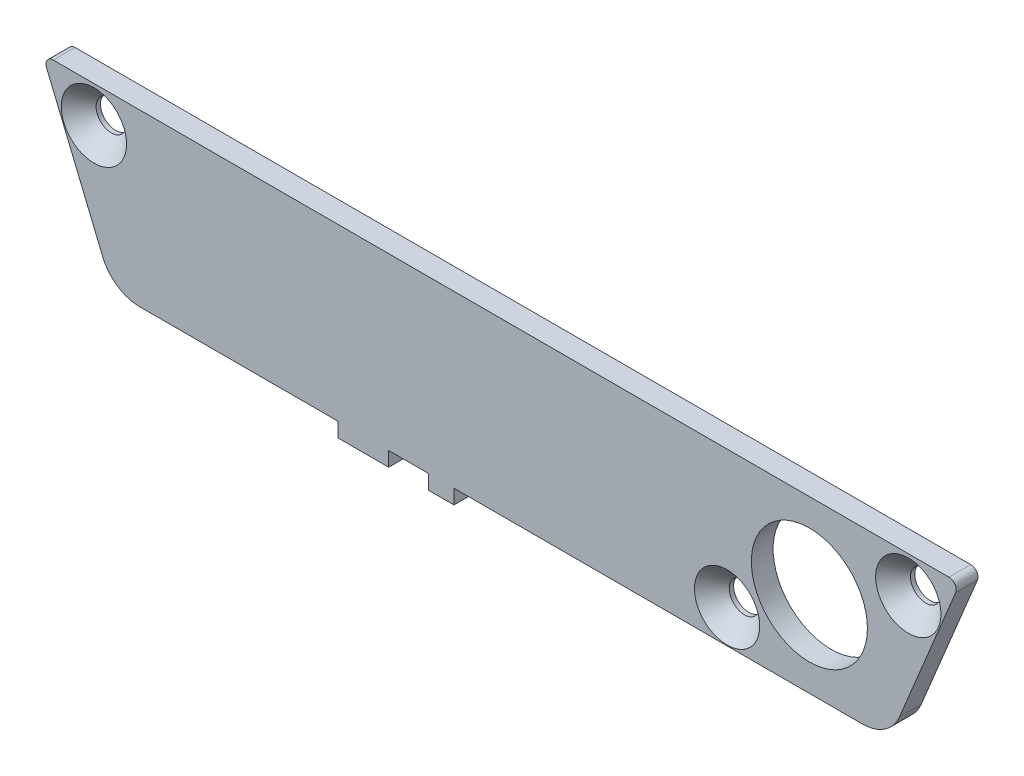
from build123d import *

# Parameters (mm, degrees)
BOSS_EXTRU_1_DEPTH                          = 3
FRAISAGE_POUR_VIS_T_TE_FRAIS_E_M41_AT_COUNT = 2
FRAISAGE_POUR_VIS_T_TE_FRAIS_E_M41_AT_PITCH = 88.387689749
FRAISAGE_POUR_VIS_T_TE_FRAIS_E_M41_2_COUNT  = 2
FRAISAGE_POUR_VIS_T_TE_FRAIS_E_M41_2_PITCH  = 112.275756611
ENL_V_MAT_EXTRU_1_REACH                     = 154.357
ESQUISSE5_R                                 = 8


with BuildPart() as part:
    # Esquisse2 → Boss.-Extru.1 (new body)
    with BuildSketch(Plane.XY.offset(134.349627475)):
        with BuildLine():
            Line((130.529448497, 76.836149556), (7.038520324, 76.836149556))
            ThreePointArc((7.038520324, 76.836149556), (6.207050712, 76.391719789), (6.114640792, 75.453466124))
            Line((6.114640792, 75.453466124), (13.869578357, 56.731390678))
            ThreePointArc((13.869578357, 56.731390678), (15.136877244, 54.873434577), (17.041914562, 53.678076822))
            ThreePointArc((17.041914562, 53.678076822), (17.981225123, 53.422306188), (18.950915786, 53.336149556))
            Line((18.950915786, 53.336149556), (46.283984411, 53.336149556))
            Line((46.283984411, 53.336149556), (46.283984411, 51.336149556))
            Line((46.283984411, 51.336149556), (53.283984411, 51.336149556))
            Line((53.283984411, 51.336149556), (53.283984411, 53.336149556))
            Line((53.283984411, 53.336149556), (58.783984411, 53.336149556))
            Line((58.783984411, 53.336149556), (58.783984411, 51.336149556))
            Line((58.783984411, 51.336149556), (62.283984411, 51.336149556))
            Line((62.283984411, 51.336149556), (62.283984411, 53.336149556))
            Line((62.283984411, 53.336149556), (118.617053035, 53.336149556))
            ThreePointArc((118.617053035, 53.336149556), (121.672689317, 54.263066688), (123.698390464, 56.731390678))
            Line((123.698390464, 56.731390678), (131.453328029, 75.453466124))
            ThreePointArc((131.453328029, 75.453466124), (131.360918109, 76.391719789), (130.529448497, 76.836149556))
        make_face()
    extrude(amount=-BOSS_EXTRU_1_DEPTH)

    # Esquisse4 → Fraisage pour vis _ t_te frais_e M41 (revolve, cut)
    with BuildSketch(Plane(origin=(12.646106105, 71.836149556, 134.349627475), x_dir=(0, -1, 0), z_dir=(1, 0, 0))):
        Polygon((0, 0), (0, 3), (2.1, 3), (2.1, 2.4), (4.5, 0), align=None)
    fraisage_pour_vis_t_te_frais_e_m41 = revolve(axis=Axis((12.646106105, 71.836149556, 140.699627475), (0, 0, -1)), mode=Mode.SUBTRACT)

    # Fraisage pour vis _ t_te frais_e M41 at: Fraisage pour vis _ t_te frais_e M41 ×2
    with Locations(*[Vector(0.9875569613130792, -0.15726171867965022, 0) * (i * FRAISAGE_POUR_VIS_T_TE_FRAIS_E_M41_AT_PITCH) for i in range(1, FRAISAGE_POUR_VIS_T_TE_FRAIS_E_M41_AT_COUNT)]):
        add(fraisage_pour_vis_t_te_frais_e_m41, mode=Mode.SUBTRACT)

    # Fraisage pour vis _ t_te frais_e M41 2: Fraisage pour vis _ t_te frais_e M41 ×2
    with Locations(*[(i * FRAISAGE_POUR_VIS_T_TE_FRAIS_E_M41_2_PITCH, 0, 0) for i in range(1, FRAISAGE_POUR_VIS_T_TE_FRAIS_E_M41_2_COUNT)]):
        add(fraisage_pour_vis_t_te_frais_e_m41, mode=Mode.SUBTRACT)

    # Esquisse5 → Enl_v. mat.-Extru.1 (cut, up to next)
    with BuildSketch(Plane.XY.offset(134.349627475), mode=Mode.PRIVATE) as enl_v_mat_extru_1_sk1:
        with Locations((111.283984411, 65.086149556)):
            Circle(ESQUISSE5_R)
    enl_v_mat_extru_1_tool1 = extrude(enl_v_mat_extru_1_sk1.sketch, amount=-ENL_V_MAT_EXTRU_1_REACH, mode=Mode.PRIVATE) & part.part
    add(enl_v_mat_extru_1_tool1.solids().sort_by_distance((111.283984, 65.08615, 134.349627))[0], mode=Mode.SUBTRACT)


solid = part.part
